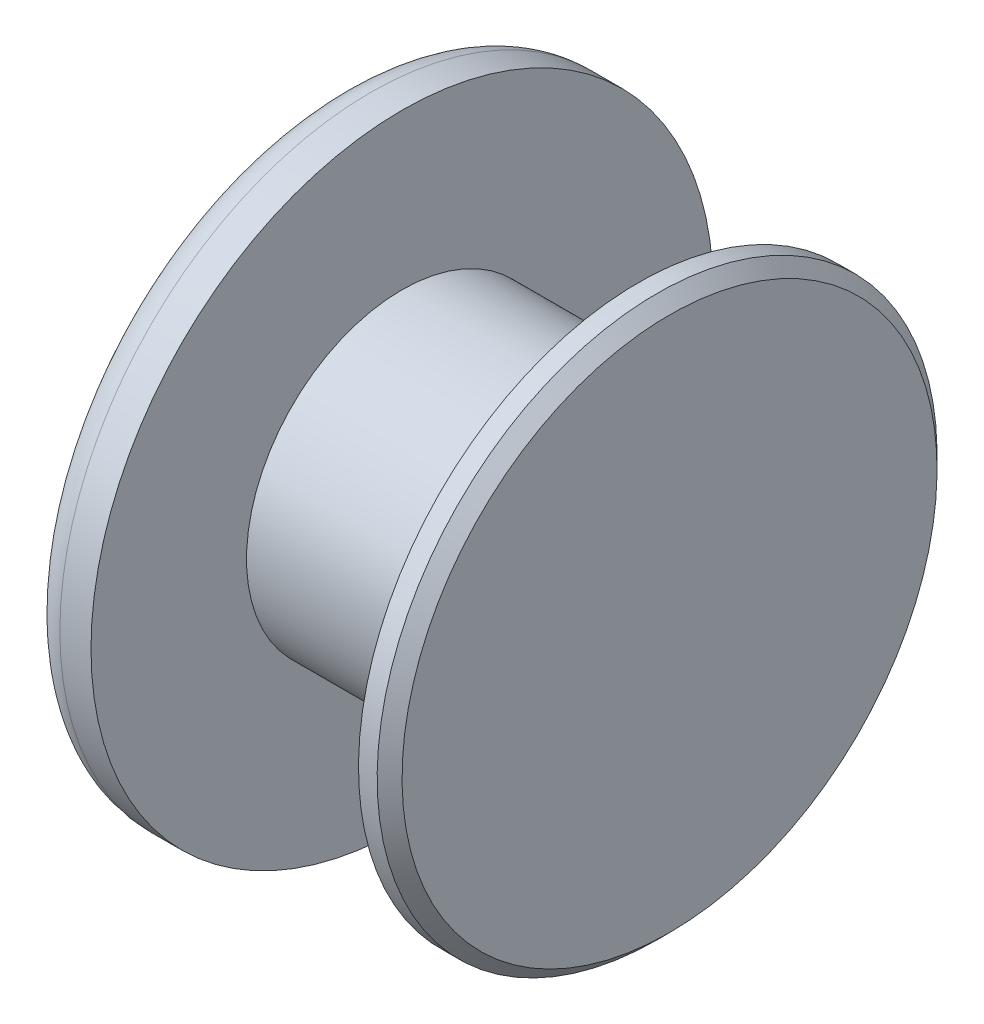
from build123d import *

# Parameters (mm, degrees)
CONG_1_R        = 0.5
CHANFREIN1_SIZE = 0.2


with BuildPart() as part:
    # Esquisse1 → R_volution1 (revolve)
    with BuildSketch(Plane.XY, mode=Mode.PRIVATE) as r_volution1_sk:
        Polygon((-2.65, 0), (-2.65, 5), (-1.65, 5), (-1.65, 2.5), (2.15, 2.5), (2.15, 4.5), (2.65, 4.5), (2.65, 0), align=None)
    revolve(r_volution1_sk.sketch.rotate(Axis((-2.65, 0, 0), (1, 0, 0)), 180), axis=Axis((-2.65, 0, 0), (1, 0, 0)))

    # Cong_1
    cong_1_edges = [part.edges().sort_by_distance(p)[0] for p in [
        (-2.65, 5, 0),
    ]]
    fillet(cong_1_edges, radius=CONG_1_R)

    # Chanfrein1
    chanfrein1_edges = [part.edges().sort_by_distance(p)[0] for p in [
        (2.65, 4.5, 0),
    ]]
    chamfer(chanfrein1_edges, length=CHANFREIN1_SIZE)


solid = part.part
